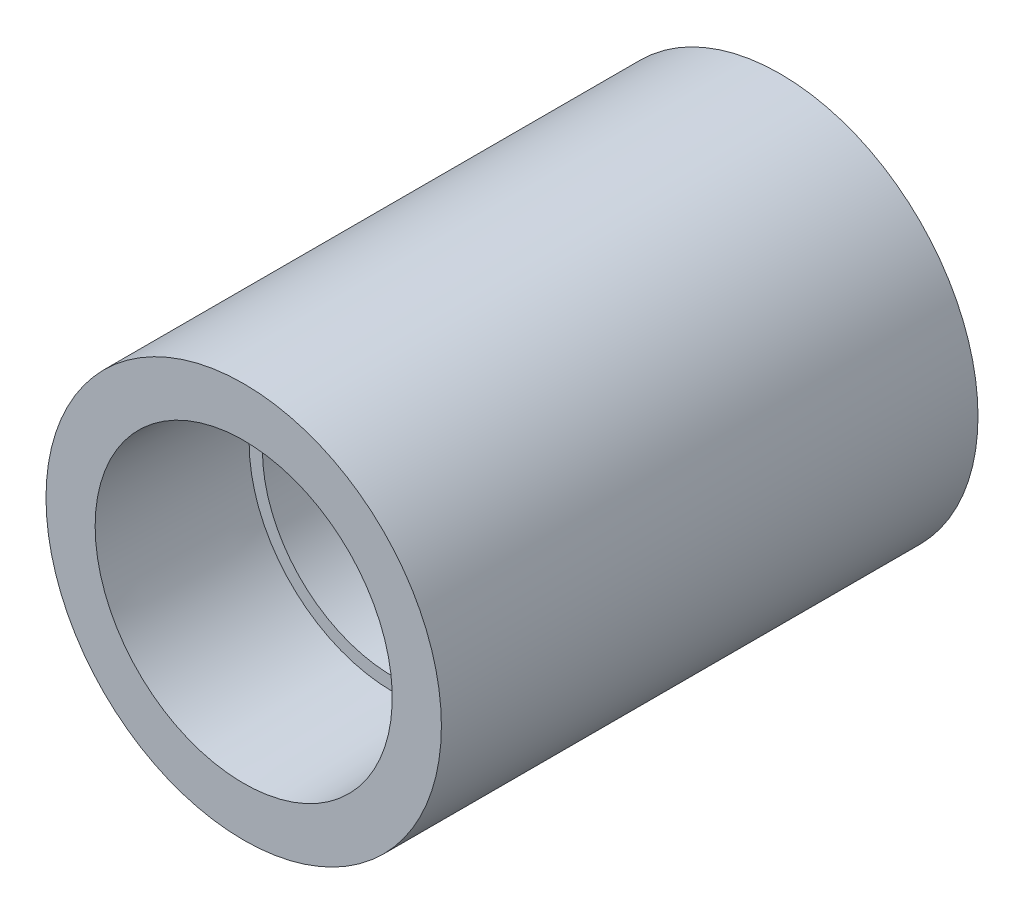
ISO-10303-21;
HEADER;
FILE_DESCRIPTION(('STEP AP214'),'2;1');
FILE_NAME('part.step','',(''),(''),'','','');
FILE_SCHEMA(('AUTOMOTIVE_DESIGN { 1 0 10303 214 1 1 1 1 }'));
ENDSEC;
DATA;
#1=APPLICATION_CONTEXT('core data for automotive mechanical design processes');
#2=APPLICATION_PROTOCOL_DEFINITION('international standard','automotive_design',2000,#1);
#3=PRODUCT_CONTEXT('',#1,'mechanical');
#4=PRODUCT('Part','Part','',(#3));
#5=PRODUCT_RELATED_PRODUCT_CATEGORY('part','',(#4));
#6=PRODUCT_DEFINITION_FORMATION('','',#4);
#7=PRODUCT_DEFINITION_CONTEXT('part definition',#1,'design');
#8=PRODUCT_DEFINITION('design','',#6,#7);
#9=PRODUCT_DEFINITION_SHAPE('','',#8);
#10=(LENGTH_UNIT() NAMED_UNIT(*) SI_UNIT(.MILLI.,.METRE.));
#11=(NAMED_UNIT(*) PLANE_ANGLE_UNIT() SI_UNIT($,.RADIAN.));
#12=(NAMED_UNIT(*) SI_UNIT($,.STERADIAN.) SOLID_ANGLE_UNIT());
#13=UNCERTAINTY_MEASURE_WITH_UNIT(LENGTH_MEASURE(1.E-05),#10,'distance_accuracy_value','');
#14=(GEOMETRIC_REPRESENTATION_CONTEXT(3) GLOBAL_UNCERTAINTY_ASSIGNED_CONTEXT((#13)) GLOBAL_UNIT_ASSIGNED_CONTEXT((#10,
#11,#12)) REPRESENTATION_CONTEXT('',''));
#15=CARTESIAN_POINT('',(0.,0.,0.));
#16=DIRECTION('',(0.,0.,1.));
#17=DIRECTION('',(1.,0.,0.));
#18=AXIS2_PLACEMENT_3D('',#15,#16,#17);
#19=CARTESIAN_POINT('',(0.,0.,60.325));
#20=DIRECTION('',(0.,0.,-1.));
#21=DIRECTION('',(-1.,0.,0.));
#22=AXIS2_PLACEMENT_3D('',#19,#20,#21);
#23=CYLINDRICAL_SURFACE('',#22,22.225);
#24=CARTESIAN_POINT('',(0.,0.,60.325));
#25=DIRECTION('',(0.,0.,1.));
#26=DIRECTION('',(1.,0.,0.));
#27=AXIS2_PLACEMENT_3D('',#24,#25,#26);
#28=CIRCLE('',#27,22.225);
#29=CARTESIAN_POINT('',(-22.225,0.,60.325));
#30=VERTEX_POINT('',#29);
#31=EDGE_CURVE('E10',#30,#30,#28,.T.);
#32=CARTESIAN_POINT('',(0.,0.,0.));
#33=DIRECTION('',(0.,0.,1.));
#34=DIRECTION('',(1.,0.,0.));
#35=AXIS2_PLACEMENT_3D('',#32,#33,#34);
#36=CIRCLE('',#35,22.225);
#37=CARTESIAN_POINT('',(-22.225,0.,0.));
#38=VERTEX_POINT('',#37);
#39=EDGE_CURVE('E39',#38,#38,#36,.T.);
#40=CARTESIAN_POINT('',(-22.225,0.,60.325));
#41=CARTESIAN_POINT('',(-22.225,0.,59.6966145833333));
#42=CARTESIAN_POINT('',(-22.225,0.,59.0682291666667));
#43=CARTESIAN_POINT('',(-22.225,0.,57.8114583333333));
#44=CARTESIAN_POINT('',(-22.225,0.,57.1830729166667));
#45=CARTESIAN_POINT('',(-22.225,0.,55.9263020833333));
#46=CARTESIAN_POINT('',(-22.225,0.,55.2979166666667));
#47=CARTESIAN_POINT('',(-22.225,0.,54.0411458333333));
#48=CARTESIAN_POINT('',(-22.225,0.,53.4127604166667));
#49=CARTESIAN_POINT('',(-22.225,0.,52.1559895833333));
#50=CARTESIAN_POINT('',(-22.225,0.,51.5276041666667));
#51=CARTESIAN_POINT('',(-22.225,0.,50.2708333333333));
#52=CARTESIAN_POINT('',(-22.225,0.,49.6424479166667));
#53=CARTESIAN_POINT('',(-22.225,0.,48.3856770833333));
#54=CARTESIAN_POINT('',(-22.225,0.,47.7572916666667));
#55=CARTESIAN_POINT('',(-22.225,0.,46.5005208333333));
#56=CARTESIAN_POINT('',(-22.225,0.,45.8721354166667));
#57=CARTESIAN_POINT('',(-22.225,0.,44.6153645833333));
#58=CARTESIAN_POINT('',(-22.225,0.,43.9869791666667));
#59=CARTESIAN_POINT('',(-22.225,0.,42.7302083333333));
#60=CARTESIAN_POINT('',(-22.225,0.,42.1018229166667));
#61=CARTESIAN_POINT('',(-22.225,0.,40.8450520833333));
#62=CARTESIAN_POINT('',(-22.225,0.,40.2166666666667));
#63=CARTESIAN_POINT('',(-22.225,0.,38.9598958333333));
#64=CARTESIAN_POINT('',(-22.225,0.,38.3315104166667));
#65=CARTESIAN_POINT('',(-22.225,0.,37.0747395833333));
#66=CARTESIAN_POINT('',(-22.225,0.,36.4463541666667));
#67=CARTESIAN_POINT('',(-22.225,0.,35.1895833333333));
#68=CARTESIAN_POINT('',(-22.225,0.,34.5611979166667));
#69=CARTESIAN_POINT('',(-22.225,0.,33.3044270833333));
#70=CARTESIAN_POINT('',(-22.225,0.,32.6760416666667));
#71=CARTESIAN_POINT('',(-22.225,0.,31.4192708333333));
#72=CARTESIAN_POINT('',(-22.225,0.,30.7908854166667));
#73=CARTESIAN_POINT('',(-22.225,0.,29.5341145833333));
#74=CARTESIAN_POINT('',(-22.225,0.,28.9057291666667));
#75=CARTESIAN_POINT('',(-22.225,0.,27.6489583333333));
#76=CARTESIAN_POINT('',(-22.225,0.,27.0205729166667));
#77=CARTESIAN_POINT('',(-22.225,0.,25.7638020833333));
#78=CARTESIAN_POINT('',(-22.225,0.,25.1354166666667));
#79=CARTESIAN_POINT('',(-22.225,0.,23.8786458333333));
#80=CARTESIAN_POINT('',(-22.225,0.,23.2502604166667));
#81=CARTESIAN_POINT('',(-22.225,0.,21.9934895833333));
#82=CARTESIAN_POINT('',(-22.225,0.,21.3651041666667));
#83=CARTESIAN_POINT('',(-22.225,0.,20.1083333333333));
#84=CARTESIAN_POINT('',(-22.225,0.,19.4799479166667));
#85=CARTESIAN_POINT('',(-22.225,0.,18.2231770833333));
#86=CARTESIAN_POINT('',(-22.225,0.,17.5947916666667));
#87=CARTESIAN_POINT('',(-22.225,0.,16.3380208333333));
#88=CARTESIAN_POINT('',(-22.225,0.,15.7096354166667));
#89=CARTESIAN_POINT('',(-22.225,0.,14.4528645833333));
#90=CARTESIAN_POINT('',(-22.225,0.,13.8244791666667));
#91=CARTESIAN_POINT('',(-22.225,0.,12.5677083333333));
#92=CARTESIAN_POINT('',(-22.225,0.,11.9393229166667));
#93=CARTESIAN_POINT('',(-22.225,0.,10.6825520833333));
#94=CARTESIAN_POINT('',(-22.225,0.,10.0541666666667));
#95=CARTESIAN_POINT('',(-22.225,0.,8.79739583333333));
#96=CARTESIAN_POINT('',(-22.225,0.,8.16901041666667));
#97=CARTESIAN_POINT('',(-22.225,0.,6.91223958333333));
#98=CARTESIAN_POINT('',(-22.225,0.,6.28385416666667));
#99=CARTESIAN_POINT('',(-22.225,0.,5.02708333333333));
#100=CARTESIAN_POINT('',(-22.225,0.,4.39869791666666));
#101=CARTESIAN_POINT('',(-22.225,0.,3.14192708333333));
#102=CARTESIAN_POINT('',(-22.225,0.,2.51354166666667));
#103=CARTESIAN_POINT('',(-22.225,0.,1.25677083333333));
#104=CARTESIAN_POINT('',(-22.225,0.,0.628385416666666));
#105=CARTESIAN_POINT('',(-22.225,0.,0.));
#106=B_SPLINE_CURVE_WITH_KNOTS('',3,(#40,#41,#42,#43,#44,#45,#46,#47,#48,#49,#50,#51,#52,#53,
#54,#55,#56,#57,#58,#59,#60,#61,#62,#63,#64,#65,#66,#67,#68,#69,#70,#71,#72,#73,#74,#75,#76,#77,
#78,#79,#80,#81,#82,#83,#84,#85,#86,#87,#88,#89,#90,#91,#92,#93,#94,#95,#96,#97,#98,#99,#100,
#101,#102,#103,#104,#105),.UNSPECIFIED.,.F.,.F.,(4,2,2,2,2,2,2,2,2,2,2,2,2,2,2,2,2,2,2,2,2,2,2,
2,2,2,2,2,2,2,2,2,4),(0.,1.88515625,3.7703125,5.65546875,7.540625,9.42578124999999,11.3109375,
13.19609375,15.08125,16.96640625,18.8515625,20.73671875,22.621875,24.50703125,26.3921875,
28.27734375,30.1625,32.04765625,33.9328125,35.81796875,37.703125,39.58828125,41.4734375,
43.35859375,45.24375,47.12890625,49.0140625,50.89921875,52.784375,54.66953125,56.5546875,
58.43984375,60.325),.UNSPECIFIED.);
#107=EDGE_CURVE('BSEAM32',#30,#38,#106,.T.);
#108=ORIENTED_EDGE('',*,*,#31,.F.);
#109=ORIENTED_EDGE('',*,*,#39,.T.);
#110=ORIENTED_EDGE('',*,*,#107,.T.);
#111=ORIENTED_EDGE('',*,*,#107,.F.);
#112=EDGE_LOOP('',(#108,#110,#109,#111));
#113=FACE_BOUND('',#112,.T.);
#114=ADVANCED_FACE('F32',(#113),#23,.T.);
#115=CARTESIAN_POINT('',(0.,0.,60.325));
#116=DIRECTION('',(0.,0.,1.));
#117=DIRECTION('',(1.,0.,0.));
#118=AXIS2_PLACEMENT_3D('',#115,#116,#117);
#119=PLANE('',#118);
#120=CARTESIAN_POINT('',(0.,0.,60.325));
#121=DIRECTION('',(0.,0.,-1.));
#122=DIRECTION('',(-1.,0.,0.));
#123=AXIS2_PLACEMENT_3D('',#120,#121,#122);
#124=CIRCLE('',#123,16.7005);
#125=CARTESIAN_POINT('',(-16.7005,0.,60.325));
#126=VERTEX_POINT('',#125);
#127=EDGE_CURVE('E53',#126,#126,#124,.T.);
#128=ORIENTED_EDGE('',*,*,#127,.T.);
#129=EDGE_LOOP('',(#128));
#130=FACE_BOUND('',#129,.T.);
#131=ORIENTED_EDGE('',*,*,#31,.T.);
#132=EDGE_LOOP('',(#131));
#133=FACE_BOUND('',#132,.T.);
#134=ADVANCED_FACE('F88',(#130,#133),#119,.T.);
#135=CARTESIAN_POINT('',(0.,0.,0.));
#136=DIRECTION('',(0.,0.,1.));
#137=DIRECTION('',(1.,0.,0.));
#138=AXIS2_PLACEMENT_3D('',#135,#136,#137);
#139=PLANE('',#138);
#140=CARTESIAN_POINT('',(0.,0.,0.));
#141=DIRECTION('',(0.,0.,-1.));
#142=DIRECTION('',(-1.,0.,0.));
#143=AXIS2_PLACEMENT_3D('',#140,#141,#142);
#144=CIRCLE('',#143,8.5725);
#145=CARTESIAN_POINT('',(-8.5725,0.,0.));
#146=VERTEX_POINT('',#145);
#147=EDGE_CURVE('E61',#146,#146,#144,.T.);
#148=ORIENTED_EDGE('',*,*,#147,.F.);
#149=EDGE_LOOP('',(#148));
#150=FACE_BOUND('',#149,.T.);
#151=ORIENTED_EDGE('',*,*,#39,.F.);
#152=EDGE_LOOP('',(#151));
#153=FACE_BOUND('',#152,.T.);
#154=ADVANCED_FACE('F93',(#150,#153),#139,.F.);
#155=CARTESIAN_POINT('',(0.,0.,43.5356));
#156=DIRECTION('',(0.,0.,-1.));
#157=DIRECTION('',(-1.,0.,0.));
#158=AXIS2_PLACEMENT_3D('',#155,#156,#157);
#159=PLANE('',#158);
#160=CARTESIAN_POINT('',(0.,0.,43.5356));
#161=DIRECTION('',(0.,0.,-1.));
#162=DIRECTION('',(-1.,0.,0.));
#163=AXIS2_PLACEMENT_3D('',#160,#161,#162);
#164=CIRCLE('',#163,16.1777604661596);
#165=CARTESIAN_POINT('',(-16.1777604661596,0.,43.5356));
#166=VERTEX_POINT('',#165);
#167=EDGE_CURVE('E47',#166,#166,#164,.T.);
#168=ORIENTED_EDGE('',*,*,#167,.F.);
#169=EDGE_LOOP('',(#168));
#170=FACE_BOUND('',#169,.T.);
#171=CARTESIAN_POINT('',(0.,0.,43.5356));
#172=DIRECTION('',(0.,0.,-1.));
#173=DIRECTION('',(-1.,0.,0.));
#174=AXIS2_PLACEMENT_3D('',#171,#172,#173);
#175=CIRCLE('',#174,14.684375);
#176=CARTESIAN_POINT('',(-14.684375,0.,43.5356));
#177=VERTEX_POINT('',#176);
#178=EDGE_CURVE('E44',#177,#177,#175,.F.);
#179=ORIENTED_EDGE('',*,*,#178,.F.);
#180=EDGE_LOOP('',(#179));
#181=FACE_BOUND('',#180,.T.);
#182=ADVANCED_FACE('F99',(#170,#181),#159,.F.);
#183=CARTESIAN_POINT('',(0.,0.,43.5356));
#184=DIRECTION('',(0.,0.,1.));
#185=DIRECTION('',(1.,0.,0.));
#186=AXIS2_PLACEMENT_3D('',#183,#184,#185);
#187=CONICAL_SURFACE('',#186,16.1777604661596,0.0311250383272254);
#188=ORIENTED_EDGE('',*,*,#127,.F.);
#189=EDGE_LOOP('',(#188));
#190=FACE_BOUND('',#189,.T.);
#191=ORIENTED_EDGE('',*,*,#167,.T.);
#192=EDGE_LOOP('',(#191));
#193=FACE_BOUND('',#192,.T.);
#194=ADVANCED_FACE('F104',(#190,#193),#187,.F.);
#195=CARTESIAN_POINT('',(0.,0.,35.1409));
#196=DIRECTION('',(0.,0.,1.));
#197=DIRECTION('',(1.,0.,0.));
#198=AXIS2_PLACEMENT_3D('',#195,#196,#197);
#199=CYLINDRICAL_SURFACE('',#198,14.684375);
#200=ORIENTED_EDGE('',*,*,#178,.T.);
#201=EDGE_LOOP('',(#200));
#202=FACE_BOUND('',#201,.T.);
#203=CARTESIAN_POINT('',(0.,0.,35.1409));
#204=DIRECTION('',(0.,0.,1.));
#205=DIRECTION('',(1.,0.,0.));
#206=AXIS2_PLACEMENT_3D('',#203,#204,#205);
#207=CIRCLE('',#206,14.684375);
#208=CARTESIAN_POINT('',(14.684375,0.,35.1409));
#209=VERTEX_POINT('',#208);
#210=EDGE_CURVE('E66',#209,#209,#207,.T.);
#211=ORIENTED_EDGE('',*,*,#210,.F.);
#212=EDGE_LOOP('',(#211));
#213=FACE_BOUND('',#212,.T.);
#214=ADVANCED_FACE('F109',(#202,#213),#199,.F.);
#215=CARTESIAN_POINT('',(0.,8.25063163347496,10.3378));
#216=DIRECTION('',(0.,0.,1.));
#217=DIRECTION('',(1.,0.,0.));
#218=AXIS2_PLACEMENT_3D('',#215,#216,#217);
#219=PLANE('',#218);
#220=CARTESIAN_POINT('',(0.,0.,10.3378));
#221=DIRECTION('',(0.,0.,-1.));
#222=DIRECTION('',(-1.,0.,0.));
#223=AXIS2_PLACEMENT_3D('',#220,#221,#222);
#224=CIRCLE('',#223,7.540625);
#225=CARTESIAN_POINT('',(-7.540625,0.,10.3378));
#226=VERTEX_POINT('',#225);
#227=EDGE_CURVE('E69',#226,#226,#224,.T.);
#228=ORIENTED_EDGE('',*,*,#227,.F.);
#229=EDGE_LOOP('',(#228));
#230=FACE_BOUND('',#229,.T.);
#231=CARTESIAN_POINT('',(0.,0.,10.3378));
#232=DIRECTION('',(0.,0.,-1.));
#233=DIRECTION('',(-1.,0.,0.));
#234=AXIS2_PLACEMENT_3D('',#231,#232,#233);
#235=CIRCLE('',#234,8.25063163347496);
#236=CARTESIAN_POINT('',(-8.25063163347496,0.,10.3378));
#237=VERTEX_POINT('',#236);
#238=EDGE_CURVE('E57',#237,#237,#235,.T.);
#239=ORIENTED_EDGE('',*,*,#238,.T.);
#240=EDGE_LOOP('',(#239));
#241=FACE_BOUND('',#240,.T.);
#242=ADVANCED_FACE('F111',(#230,#241),#219,.F.);
#243=CARTESIAN_POINT('',(0.,0.,0.));
#244=DIRECTION('',(0.,0.,-1.));
#245=DIRECTION('',(-1.,0.,0.));
#246=AXIS2_PLACEMENT_3D('',#243,#244,#245);
#247=CONICAL_SURFACE('',#246,8.5725,0.0311250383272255);
#248=ORIENTED_EDGE('',*,*,#238,.F.);
#249=EDGE_LOOP('',(#248));
#250=FACE_BOUND('',#249,.T.);
#251=ORIENTED_EDGE('',*,*,#147,.T.);
#252=EDGE_LOOP('',(#251));
#253=FACE_BOUND('',#252,.T.);
#254=ADVANCED_FACE('F85',(#250,#253),#247,.F.);
#255=CARTESIAN_POINT('',(0.,0.,35.1409));
#256=DIRECTION('',(0.,0.,1.));
#257=DIRECTION('',(1.,0.,0.));
#258=AXIS2_PLACEMENT_3D('',#255,#256,#257);
#259=CONICAL_SURFACE('',#258,14.684375,0.5235987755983);
#260=CARTESIAN_POINT('',(0.,0.,22.7675620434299));
#261=DIRECTION('',(0.,0.,1.));
#262=DIRECTION('',(1.,0.,0.));
#263=AXIS2_PLACEMENT_3D('',#260,#261,#262);
#264=CIRCLE('',#263,7.540625);
#265=CARTESIAN_POINT('',(7.540625,0.,22.7675620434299));
#266=VERTEX_POINT('',#265);
#267=EDGE_CURVE('E35',#266,#266,#264,.F.);
#268=ORIENTED_EDGE('',*,*,#267,.T.);
#269=EDGE_LOOP('',(#268));
#270=FACE_BOUND('',#269,.T.);
#271=ORIENTED_EDGE('',*,*,#210,.T.);
#272=EDGE_LOOP('',(#271));
#273=FACE_BOUND('',#272,.T.);
#274=ADVANCED_FACE('F76',(#270,#273),#259,.F.);
#275=CARTESIAN_POINT('',(0.,0.,60.325));
#276=DIRECTION('',(0.,0.,-1.));
#277=DIRECTION('',(-1.,0.,0.));
#278=AXIS2_PLACEMENT_3D('',#275,#276,#277);
#279=CYLINDRICAL_SURFACE('',#278,7.540625);
#280=ORIENTED_EDGE('',*,*,#227,.T.);
#281=EDGE_LOOP('',(#280));
#282=FACE_BOUND('',#281,.T.);
#283=ORIENTED_EDGE('',*,*,#267,.F.);
#284=EDGE_LOOP('',(#283));
#285=FACE_BOUND('',#284,.T.);
#286=ADVANCED_FACE('F79',(#282,#285),#279,.F.);
#287=CLOSED_SHELL('',(#114,#134,#154,#182,#194,#214,#242,#254,#274,#286));
#288=MANIFOLD_SOLID_BREP('B2',#287);
#289=ADVANCED_BREP_SHAPE_REPRESENTATION('',(#18,#288),#14);
#290=SHAPE_DEFINITION_REPRESENTATION(#9,#289);
ENDSEC;
END-ISO-10303-21;
